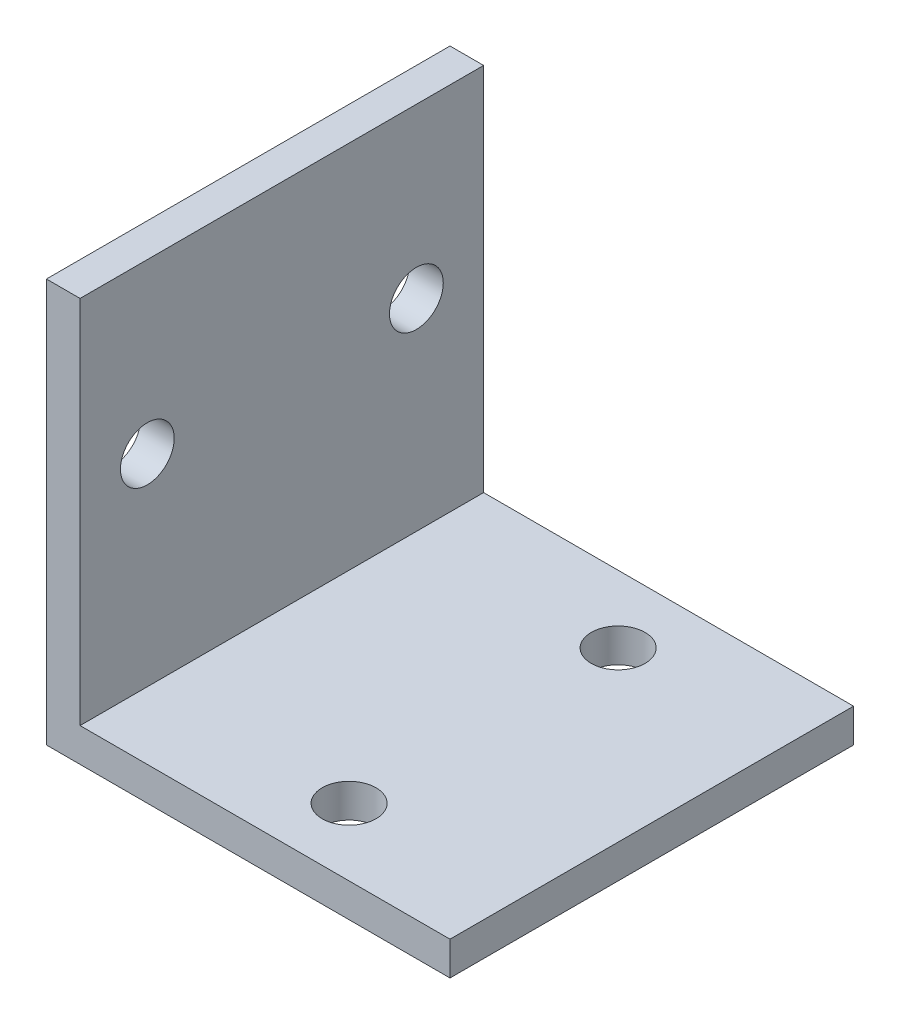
from build123d import *

# Parameters (mm, degrees)
BOSS_EXTRUDE1_DEPTH = 30
SKETCH3_R           = 4
CUT_EXTRUDE1_DEPTH  = 87.746757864
SKETCH2_R           = 4
CUT_EXTRUDE2_DEPTH  = 87.746757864


with BuildPart() as part:
    # Sketch1 → Boss-Extrude1 (new, symmetric)
    with BuildSketch(Plane.XY):
        Polygon((0, 60), (0, 0), (60, 0), (60, 5), (5, 5), (5, 60), align=None)
    extrude(amount=BOSS_EXTRUDE1_DEPTH, both=True)

    # Sketch3 → Cut-Extrude1 (cut, through all)
    with BuildSketch(Plane(origin=(0, 5, 0), x_dir=(1, 0, 0), z_dir=(0, 1, 0))):
        with Locations(Location((35, 20, 0), (0, 0, 270))):
            Circle(SKETCH3_R)
        with Locations(Location((35, -20, 0), (0, 0, 270))):
            Circle(SKETCH3_R)
    extrude(amount=-CUT_EXTRUDE1_DEPTH, mode=Mode.SUBTRACT)

    # Sketch2 → Cut-Extrude2 (cut, through all)
    with BuildSketch(Plane(origin=(5, 0, 0), x_dir=(0, 0, -1), z_dir=(1, 0, 0))):
        with Locations((-20, 35)):
            Circle(SKETCH2_R)
        with Locations((20, 35)):
            Circle(SKETCH2_R)
    extrude(amount=-CUT_EXTRUDE2_DEPTH, mode=Mode.SUBTRACT)


solid = part.part
